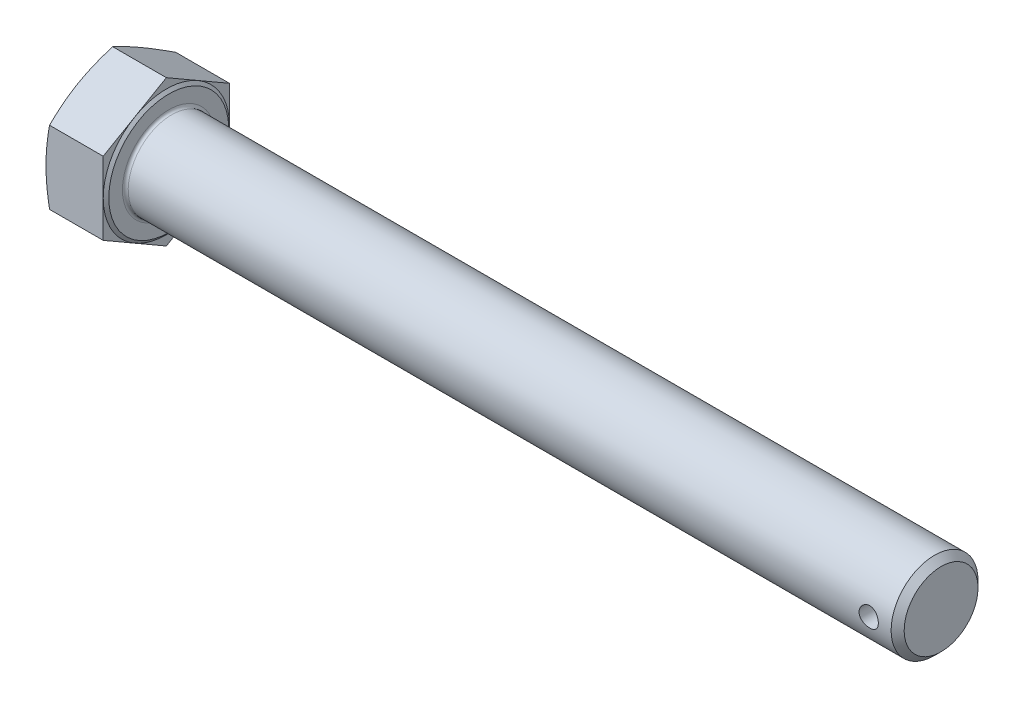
ISO-10303-21;
HEADER;
FILE_DESCRIPTION(('STEP AP214'),'2;1');
FILE_NAME('part.step','',(''),(''),'','','');
FILE_SCHEMA(('AUTOMOTIVE_DESIGN { 1 0 10303 214 1 1 1 1 }'));
ENDSEC;
DATA;
#1=APPLICATION_CONTEXT('core data for automotive mechanical design processes');
#2=APPLICATION_PROTOCOL_DEFINITION('international standard','automotive_design',2000,#1);
#3=PRODUCT_CONTEXT('',#1,'mechanical');
#4=PRODUCT('Part','Part','',(#3));
#5=PRODUCT_RELATED_PRODUCT_CATEGORY('part','',(#4));
#6=PRODUCT_DEFINITION_FORMATION('','',#4);
#7=PRODUCT_DEFINITION_CONTEXT('part definition',#1,'design');
#8=PRODUCT_DEFINITION('design','',#6,#7);
#9=PRODUCT_DEFINITION_SHAPE('','',#8);
#10=(LENGTH_UNIT() NAMED_UNIT(*) SI_UNIT(.MILLI.,.METRE.));
#11=(NAMED_UNIT(*) PLANE_ANGLE_UNIT() SI_UNIT($,.RADIAN.));
#12=(NAMED_UNIT(*) SI_UNIT($,.STERADIAN.) SOLID_ANGLE_UNIT());
#13=UNCERTAINTY_MEASURE_WITH_UNIT(LENGTH_MEASURE(1.E-05),#10,'distance_accuracy_value','');
#14=(GEOMETRIC_REPRESENTATION_CONTEXT(3) GLOBAL_UNCERTAINTY_ASSIGNED_CONTEXT((#13)) GLOBAL_UNIT_ASSIGNED_CONTEXT((#10,
#11,#12)) REPRESENTATION_CONTEXT('',''));
#15=CARTESIAN_POINT('',(0.,0.,0.));
#16=DIRECTION('',(0.,0.,1.));
#17=DIRECTION('',(1.,0.,0.));
#18=AXIS2_PLACEMENT_3D('',#15,#16,#17);
#19=CARTESIAN_POINT('',(12.35,0.,0.));
#20=DIRECTION('',(-1.,0.,0.));
#21=DIRECTION('',(0.,-1.,0.));
#22=AXIS2_PLACEMENT_3D('',#19,#20,#21);
#23=PLANE('',#22);
#24=CARTESIAN_POINT('',(12.35,0.,0.));
#25=DIRECTION('',(-1.,0.,0.));
#26=DIRECTION('',(0.,-1.,0.));
#27=AXIS2_PLACEMENT_3D('',#24,#25,#26);
#28=CIRCLE('',#27,9.6);
#29=CARTESIAN_POINT('',(12.35,-9.6,0.));
#30=VERTEX_POINT('',#29);
#31=EDGE_CURVE('E11',#30,#30,#28,.T.);
#32=ORIENTED_EDGE('',*,*,#31,.T.);
#33=EDGE_LOOP('',(#32));
#34=FACE_BOUND('',#33,.T.);
#35=CARTESIAN_POINT('',(12.35,0.,0.));
#36=DIRECTION('',(-1.,0.,0.));
#37=DIRECTION('',(0.,-1.,0.));
#38=AXIS2_PLACEMENT_3D('',#35,#36,#37);
#39=CIRCLE('',#38,12.425);
#40=CARTESIAN_POINT('',(12.35,-12.425,0.));
#41=VERTEX_POINT('',#40);
#42=EDGE_CURVE('E146',#41,#41,#39,.T.);
#43=ORIENTED_EDGE('',*,*,#42,.F.);
#44=EDGE_LOOP('',(#43));
#45=FACE_BOUND('',#44,.T.);
#46=ADVANCED_FACE('F32',(#34,#45),#23,.F.);
#47=CARTESIAN_POINT('',(11.85,0.,26.16));
#48=DIRECTION('',(-1.,0.,0.));
#49=DIRECTION('',(0.,0.,1.));
#50=AXIS2_PLACEMENT_3D('',#47,#48,#49);
#51=PLANE('',#50);
#52=DIRECTION('',(0.,-0.5,-0.866025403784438));
#53=VECTOR('',#52,1.);
#54=CARTESIAN_POINT('',(11.85,-7.5517415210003,13.08));
#55=LINE('',#54,#53);
#56=CARTESIAN_POINT('',(11.85,-7.5517415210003,13.08));
#57=VERTEX_POINT('',#56);
#58=CARTESIAN_POINT('',(11.85,-11.3276122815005,6.54));
#59=VERTEX_POINT('',#58);
#60=EDGE_CURVE('E145',#57,#59,#55,.T.);
#61=ORIENTED_EDGE('',*,*,#60,.T.);
#62=CARTESIAN_POINT('',(11.85,0.,0.));
#63=DIRECTION('',(-1.,0.,0.));
#64=DIRECTION('',(0.,-1.,0.));
#65=AXIS2_PLACEMENT_3D('',#62,#63,#64);
#66=CIRCLE('',#65,13.08);
#67=CARTESIAN_POINT('',(11.85,0.,13.08));
#68=VERTEX_POINT('',#67);
#69=EDGE_CURVE('E54',#59,#68,#66,.T.);
#70=ORIENTED_EDGE('',*,*,#69,.T.);
#71=DIRECTION('',(0.,-1.,0.));
#72=VECTOR('',#71,1.);
#73=CARTESIAN_POINT('',(11.85,7.55174152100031,13.08));
#74=LINE('',#73,#72);
#75=EDGE_CURVE('E142',#68,#57,#74,.T.);
#76=ORIENTED_EDGE('',*,*,#75,.T.);
#77=EDGE_LOOP('',(#61,#70,#76));
#78=FACE_BOUND('',#77,.T.);
#79=ADVANCED_FACE('F141',(#78),#51,.F.);
#80=CARTESIAN_POINT('',(11.85,7.55174152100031,13.08));
#81=VERTEX_POINT('',#80);
#82=EDGE_CURVE('E153',#81,#68,#74,.T.);
#83=ORIENTED_EDGE('',*,*,#82,.T.);
#84=CARTESIAN_POINT('',(11.85,11.3276122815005,6.54));
#85=VERTEX_POINT('',#84);
#86=EDGE_CURVE('E128',#68,#85,#66,.T.);
#87=ORIENTED_EDGE('',*,*,#86,.T.);
#88=DIRECTION('',(0.,-0.5,0.866025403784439));
#89=VECTOR('',#88,1.);
#90=CARTESIAN_POINT('',(11.85,15.1034830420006,0.));
#91=LINE('',#90,#89);
#92=EDGE_CURVE('E159',#85,#81,#91,.T.);
#93=ORIENTED_EDGE('',*,*,#92,.T.);
#94=EDGE_LOOP('',(#83,#87,#93));
#95=FACE_BOUND('',#94,.T.);
#96=ADVANCED_FACE('F158',(#95),#51,.F.);
#97=CARTESIAN_POINT('',(11.85,15.1034830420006,0.));
#98=VERTEX_POINT('',#97);
#99=EDGE_CURVE('E156',#98,#85,#91,.T.);
#100=ORIENTED_EDGE('',*,*,#99,.T.);
#101=CARTESIAN_POINT('',(11.85,11.3276122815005,-6.54));
#102=VERTEX_POINT('',#101);
#103=EDGE_CURVE('E132',#85,#102,#66,.T.);
#104=ORIENTED_EDGE('',*,*,#103,.T.);
#105=DIRECTION('',(0.,0.5,0.866025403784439));
#106=VECTOR('',#105,1.);
#107=CARTESIAN_POINT('',(11.85,7.55174152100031,-13.08));
#108=LINE('',#107,#106);
#109=EDGE_CURVE('E325',#102,#98,#108,.T.);
#110=ORIENTED_EDGE('',*,*,#109,.T.);
#111=EDGE_LOOP('',(#100,#104,#110));
#112=FACE_BOUND('',#111,.T.);
#113=ADVANCED_FACE('F314',(#112),#51,.F.);
#114=CARTESIAN_POINT('',(11.85,7.55174152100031,-13.08));
#115=VERTEX_POINT('',#114);
#116=EDGE_CURVE('E328',#115,#102,#108,.T.);
#117=ORIENTED_EDGE('',*,*,#116,.T.);
#118=CARTESIAN_POINT('',(11.85,0.,-13.08));
#119=VERTEX_POINT('',#118);
#120=EDGE_CURVE('E386',#102,#119,#66,.T.);
#121=ORIENTED_EDGE('',*,*,#120,.T.);
#122=DIRECTION('',(0.,1.,0.));
#123=VECTOR('',#122,1.);
#124=CARTESIAN_POINT('',(11.85,-7.55174152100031,-13.08));
#125=LINE('',#124,#123);
#126=EDGE_CURVE('E326',#119,#115,#125,.T.);
#127=ORIENTED_EDGE('',*,*,#126,.T.);
#128=EDGE_LOOP('',(#117,#121,#127));
#129=FACE_BOUND('',#128,.T.);
#130=ADVANCED_FACE('F307',(#129),#51,.F.);
#131=CARTESIAN_POINT('',(11.85,-7.55174152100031,-13.08));
#132=VERTEX_POINT('',#131);
#133=EDGE_CURVE('E319',#132,#119,#125,.T.);
#134=ORIENTED_EDGE('',*,*,#133,.T.);
#135=CARTESIAN_POINT('',(11.85,-11.3276122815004,-6.53999999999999));
#136=VERTEX_POINT('',#135);
#137=EDGE_CURVE('E320',#119,#136,#66,.T.);
#138=ORIENTED_EDGE('',*,*,#137,.T.);
#139=DIRECTION('',(0.,0.5,-0.866025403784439));
#140=VECTOR('',#139,1.);
#141=CARTESIAN_POINT('',(11.85,-15.1034830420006,0.));
#142=LINE('',#141,#140);
#143=EDGE_CURVE('E322',#136,#132,#142,.T.);
#144=ORIENTED_EDGE('',*,*,#143,.T.);
#145=EDGE_LOOP('',(#134,#138,#144));
#146=FACE_BOUND('',#145,.T.);
#147=ADVANCED_FACE('F299',(#146),#51,.F.);
#148=CARTESIAN_POINT('',(11.85,-7.5517415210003,13.08));
#149=DIRECTION('',(0.,0.866025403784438,-0.5));
#150=DIRECTION('',(0.,0.5,0.866025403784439));
#151=AXIS2_PLACEMENT_3D('',#148,#149,#150);
#152=PLANE('',#151);
#153=CARTESIAN_POINT('',(0.736529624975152,-15.1035985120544,-0.000199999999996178));
#154=CARTESIAN_POINT('',(0.62266016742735,-14.7908547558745,0.541488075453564));
#155=CARTESIAN_POINT('',(0.519076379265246,-14.4770797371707,1.08496234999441));
#156=CARTESIAN_POINT('',(0.336836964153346,-13.8474895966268,2.17544446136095));
#157=CARTESIAN_POINT('',(0.258200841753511,-13.5316730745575,2.72245472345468));
#158=CARTESIAN_POINT('',(0.131009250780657,-12.9015045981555,3.81393854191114));
#159=CARTESIAN_POINT('',(0.082176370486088,-12.5871670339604,4.35838717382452));
#160=CARTESIAN_POINT('',(0.0166777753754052,-11.9577568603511,5.4485575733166));
#161=CARTESIAN_POINT('',(0.,-11.6426845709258,5.9942787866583));
#162=CARTESIAN_POINT('',(0.,-11.0125399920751,7.08572121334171));
#163=CARTESIAN_POINT('',(0.0166777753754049,-10.6974677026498,7.63144242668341));
#164=CARTESIAN_POINT('',(0.0821763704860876,-10.0680575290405,8.72161282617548));
#165=CARTESIAN_POINT('',(0.131009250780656,-9.75371996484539,9.26606145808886));
#166=CARTESIAN_POINT('',(0.258200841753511,-9.12355148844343,10.3575452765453));
#167=CARTESIAN_POINT('',(0.336836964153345,-8.80773496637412,10.9045555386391));
#168=CARTESIAN_POINT('',(0.519076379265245,-8.17814482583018,11.9950376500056));
#169=CARTESIAN_POINT('',(0.622660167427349,-7.86436980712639,12.5385119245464));
#170=CARTESIAN_POINT('',(0.736529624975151,-7.55162605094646,13.0802));
#171=B_SPLINE_CURVE_WITH_KNOTS('',3,(#153,#154,#155,#156,#157,#158,#159,#160,#161,#162,#163,
#164,#165,#166,#167,#168,#169,#170),.UNSPECIFIED.,.F.,.F.,(4,2,2,2,2,2,2,2,4),(0.,
1.90750055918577,3.81648878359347,5.70742558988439,7.59765301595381,9.48788044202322,
11.3788172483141,13.2878054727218,15.1953060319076),.UNSPECIFIED.);
#172=CARTESIAN_POINT('',(0.73648759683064,-15.1034830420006,0.));
#173=VERTEX_POINT('',#172);
#174=CARTESIAN_POINT('',(0.,-11.3276122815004,6.54));
#175=VERTEX_POINT('',#174);
#176=EDGE_CURVE('E367',#173,#175,#171,.T.);
#177=ORIENTED_EDGE('',*,*,#176,.F.);
#178=DIRECTION('',(-1.,0.,0.));
#179=VECTOR('',#178,1.);
#180=CARTESIAN_POINT('',(11.85,-15.1034830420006,0.));
#181=LINE('',#180,#179);
#182=CARTESIAN_POINT('',(11.85,-15.1034830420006,0.));
#183=VERTEX_POINT('',#182);
#184=EDGE_CURVE('E176',#183,#173,#181,.T.);
#185=ORIENTED_EDGE('',*,*,#184,.F.);
#186=EDGE_CURVE('E375',#59,#183,#55,.T.);
#187=ORIENTED_EDGE('',*,*,#186,.F.);
#188=ORIENTED_EDGE('',*,*,#60,.F.);
#189=DIRECTION('',(-1.,0.,0.));
#190=VECTOR('',#189,1.);
#191=CARTESIAN_POINT('',(11.85,-7.5517415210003,13.08));
#192=LINE('',#191,#190);
#193=CARTESIAN_POINT('',(0.736487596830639,-7.5517415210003,13.08));
#194=VERTEX_POINT('',#193);
#195=EDGE_CURVE('E155',#57,#194,#192,.T.);
#196=ORIENTED_EDGE('',*,*,#195,.T.);
#197=EDGE_CURVE('E256',#175,#194,#171,.T.);
#198=ORIENTED_EDGE('',*,*,#197,.F.);
#199=EDGE_LOOP('',(#177,#185,#187,#188,#196,#198));
#200=FACE_BOUND('',#199,.T.);
#201=ADVANCED_FACE('F34',(#200),#152,.F.);
#202=CARTESIAN_POINT('',(11.85,-15.1034830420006,0.));
#203=DIRECTION('',(0.,0.866025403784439,0.5));
#204=DIRECTION('',(0.,-0.5,0.866025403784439));
#205=AXIS2_PLACEMENT_3D('',#202,#203,#204);
#206=PLANE('',#205);
#207=CARTESIAN_POINT('',(0.736529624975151,-7.55162605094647,-13.0802));
#208=CARTESIAN_POINT('',(0.62266016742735,-7.86436980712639,-12.5385119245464));
#209=CARTESIAN_POINT('',(0.519076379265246,-8.17814482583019,-11.9950376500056));
#210=CARTESIAN_POINT('',(0.336836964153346,-8.80773496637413,-10.9045555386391));
#211=CARTESIAN_POINT('',(0.258200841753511,-9.12355148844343,-10.3575452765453));
#212=CARTESIAN_POINT('',(0.131009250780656,-9.75371996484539,-9.26606145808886));
#213=CARTESIAN_POINT('',(0.0821763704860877,-10.0680575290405,-8.72161282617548));
#214=CARTESIAN_POINT('',(0.0166777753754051,-10.6974677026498,-7.6314424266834));
#215=CARTESIAN_POINT('',(0.,-11.0125399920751,-7.0857212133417));
#216=CARTESIAN_POINT('',(0.,-11.6426845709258,-5.99427878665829));
#217=CARTESIAN_POINT('',(0.0166777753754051,-11.9577568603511,-5.44855757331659));
#218=CARTESIAN_POINT('',(0.0821763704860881,-12.5871670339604,-4.35838717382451));
#219=CARTESIAN_POINT('',(0.131009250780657,-12.9015045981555,-3.81393854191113));
#220=CARTESIAN_POINT('',(0.258200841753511,-13.5316730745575,-2.72245472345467));
#221=CARTESIAN_POINT('',(0.336836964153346,-13.8474895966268,-2.17544446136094));
#222=CARTESIAN_POINT('',(0.519076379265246,-14.4770797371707,-1.08496234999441));
#223=CARTESIAN_POINT('',(0.62266016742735,-14.7908547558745,-0.541488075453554));
#224=CARTESIAN_POINT('',(0.736529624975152,-15.1035985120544,0.000200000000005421));
#225=B_SPLINE_CURVE_WITH_KNOTS('',3,(#207,#208,#209,#210,#211,#212,#213,#214,#215,#216,#217,
#218,#219,#220,#221,#222,#223,#224),.UNSPECIFIED.,.F.,.F.,(4,2,2,2,2,2,2,2,4),(0.,
1.90750055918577,3.81648878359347,5.70742558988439,7.59765301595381,9.48788044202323,
11.3788172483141,13.2878054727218,15.1953060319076),.UNSPECIFIED.);
#226=CARTESIAN_POINT('',(0.736487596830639,-7.5517415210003,-13.08));
#227=VERTEX_POINT('',#226);
#228=CARTESIAN_POINT('',(0.,-11.3276122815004,-6.53999999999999));
#229=VERTEX_POINT('',#228);
#230=EDGE_CURVE('E271',#227,#229,#225,.T.);
#231=ORIENTED_EDGE('',*,*,#230,.F.);
#232=DIRECTION('',(-1.,0.,0.));
#233=VECTOR('',#232,1.);
#234=CARTESIAN_POINT('',(11.85,-7.55174152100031,-13.08));
#235=LINE('',#234,#233);
#236=EDGE_CURVE('E173',#132,#227,#235,.T.);
#237=ORIENTED_EDGE('',*,*,#236,.F.);
#238=ORIENTED_EDGE('',*,*,#143,.F.);
#239=EDGE_CURVE('E329',#183,#136,#142,.T.);
#240=ORIENTED_EDGE('',*,*,#239,.F.);
#241=ORIENTED_EDGE('',*,*,#184,.T.);
#242=EDGE_CURVE('E267',#229,#173,#225,.T.);
#243=ORIENTED_EDGE('',*,*,#242,.F.);
#244=EDGE_LOOP('',(#231,#237,#238,#240,#241,#243));
#245=FACE_BOUND('',#244,.T.);
#246=ADVANCED_FACE('F278',(#245),#206,.F.);
#247=CARTESIAN_POINT('',(11.85,-7.55174152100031,-13.08));
#248=DIRECTION('',(0.,0.,1.));
#249=DIRECTION('',(0.,-1.,0.));
#250=AXIS2_PLACEMENT_3D('',#247,#248,#249);
#251=PLANE('',#250);
#252=CARTESIAN_POINT('',(3.93549834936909,-19.9943584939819,-13.08));
#253=CARTESIAN_POINT('',(3.84537692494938,-19.6984695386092,-13.08));
#254=CARTESIAN_POINT('',(3.75580051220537,-19.402414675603,-13.08));
#255=CARTESIAN_POINT('',(3.57785972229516,-18.8099391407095,-13.08));
#256=CARTESIAN_POINT('',(3.48949535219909,-18.5135184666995,-13.08));
#257=CARTESIAN_POINT('',(3.22639193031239,-17.623618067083,-13.08));
#258=CARTESIAN_POINT('',(3.05365592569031,-17.0295436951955,-13.08));
#259=CARTESIAN_POINT('',(2.71443961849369,-15.8384086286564,-13.08));
#260=CARTESIAN_POINT('',(2.54797158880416,-15.2413444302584,-13.08));
#261=CARTESIAN_POINT('',(2.22322585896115,-14.0449953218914,-13.08));
#262=CARTESIAN_POINT('',(2.06494801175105,-13.4457104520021,-13.08));
#263=CARTESIAN_POINT('',(1.76050409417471,-12.2519256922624,-13.08));
#264=CARTESIAN_POINT('',(1.61421275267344,-11.6574579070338,-13.08));
#265=CARTESIAN_POINT('',(1.33408482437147,-10.4655642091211,-13.08));
#266=CARTESIAN_POINT('',(1.20024844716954,-9.8681382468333,-13.08));
#267=CARTESIAN_POINT('',(0.948150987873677,-8.67019448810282,-13.08));
#268=CARTESIAN_POINT('',(0.829884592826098,-8.06967781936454,-13.08));
#269=CARTESIAN_POINT('',(0.61252820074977,-6.86515806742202,-13.08));
#270=CARTESIAN_POINT('',(0.513437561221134,-6.26115510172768,-13.08));
#271=CARTESIAN_POINT('',(0.348269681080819,-5.1176759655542,-13.08));
#272=CARTESIAN_POINT('',(0.279736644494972,-4.57855785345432,-13.08));
#273=CARTESIAN_POINT('',(0.163726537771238,-3.49804197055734,-13.08));
#274=CARTESIAN_POINT('',(0.11624885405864,-2.95664426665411,-13.08));
#275=CARTESIAN_POINT('',(0.0446358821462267,-1.87266735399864,-13.08));
#276=CARTESIAN_POINT('',(0.0204840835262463,-1.33008925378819,-13.08));
#277=CARTESIAN_POINT('',(-0.00325431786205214,-0.244390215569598,-13.08));
#278=CARTESIAN_POINT('',(-0.00284109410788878,0.298730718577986,-13.08));
#279=CARTESIAN_POINT('',(0.0225924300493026,1.38714249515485,-13.08));
#280=CARTESIAN_POINT('',(0.0477375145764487,1.93243037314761,-13.08));
#281=CARTESIAN_POINT('',(0.121477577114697,3.02140448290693,-13.08));
#282=CARTESIAN_POINT('',(0.170073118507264,3.56509067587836,-13.08));
#283=CARTESIAN_POINT('',(0.288440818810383,4.65059295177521,-13.08));
#284=CARTESIAN_POINT('',(0.358231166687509,5.19240702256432,-13.08));
#285=CARTESIAN_POINT('',(0.516157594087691,6.27332459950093,-13.08));
#286=CARTESIAN_POINT('',(0.604293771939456,6.8124280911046,-13.08));
#287=CARTESIAN_POINT('',(0.801115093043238,7.91629318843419,-13.08));
#288=CARTESIAN_POINT('',(0.910640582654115,8.48090362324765,-13.08));
#289=CARTESIAN_POINT('',(1.1437881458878,9.60722508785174,-13.08));
#290=CARTESIAN_POINT('',(1.26741128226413,10.1689358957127,-13.08));
#291=CARTESIAN_POINT('',(1.52615829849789,11.2898583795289,-13.08));
#292=CARTESIAN_POINT('',(1.66128551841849,11.8490692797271,-13.08));
#293=CARTESIAN_POINT('',(1.940842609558,12.9651353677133,-13.08));
#294=CARTESIAN_POINT('',(2.08527225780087,13.5219906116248,-13.08));
#295=CARTESIAN_POINT('',(2.3818855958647,14.634390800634,-13.08));
#296=CARTESIAN_POINT('',(2.53407900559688,15.1899331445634,-13.08));
#297=CARTESIAN_POINT('',(2.84465724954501,16.2992820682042,-13.08));
#298=CARTESIAN_POINT('',(3.0030421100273,16.8530886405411,-13.08));
#299=CARTESIAN_POINT('',(3.32486841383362,17.9591267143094,-13.08));
#300=CARTESIAN_POINT('',(3.48830900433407,18.5113584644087,-13.08));
#301=CARTESIAN_POINT('',(3.81939964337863,19.6145548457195,-13.08));
#302=CARTESIAN_POINT('',(3.98704968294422,20.1655194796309,-13.08));
#303=CARTESIAN_POINT('',(4.4914870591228,21.8046460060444,-13.08));
#304=CARTESIAN_POINT('',(4.83335007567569,22.8912455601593,-13.08));
#305=CARTESIAN_POINT('',(5.52676383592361,25.0613908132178,-13.08));
#306=CARTESIAN_POINT('',(5.87831504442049,26.1449363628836,-13.08));
#307=CARTESIAN_POINT('',(6.58717433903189,28.3055867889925,-13.08));
#308=CARTESIAN_POINT('',(6.94445552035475,29.382700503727,-13.08));
#309=CARTESIAN_POINT('',(7.48434059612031,30.9969938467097,-13.08));
#310=CARTESIAN_POINT('',(7.6649554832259,31.5348404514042,-13.08));
#311=CARTESIAN_POINT('',(8.02735396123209,32.6101383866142,-13.08));
#312=CARTESIAN_POINT('',(8.20913754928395,33.1475897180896,-13.08));
#313=CARTESIAN_POINT('',(8.39142742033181,33.6848693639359,-13.08));
#314=B_SPLINE_CURVE_WITH_KNOTS('',3,(#252,#253,#254,#255,#256,#257,#258,#259,#260,#261,#262,
#263,#264,#265,#266,#267,#268,#269,#270,#271,#272,#273,#274,#275,#276,#277,#278,#279,#280,#281,
#282,#283,#284,#285,#286,#287,#288,#289,#290,#291,#292,#293,#294,#295,#296,#297,#298,#299,#300,
#301,#302,#303,#304,#305,#306,#307,#308,#309,#310,#311,#312,#313),.UNSPECIFIED.,.F.,.F.,(4,2,2,
2,2,2,2,2,2,2,2,2,2,2,2,2,2,2,2,2,2,2,2,2,2,2,2,2,2,2,4),(0.,0.927926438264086,1.85585828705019,
3.71185915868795,5.57132286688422,7.43075317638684,9.26725767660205,11.1037930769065,
12.9397001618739,14.775545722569,16.4055576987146,18.0355221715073,19.6643320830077,
21.2931304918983,22.9301893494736,24.5672875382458,26.2057946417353,27.8443105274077,
29.5694962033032,31.2948120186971,33.0206304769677,34.7464075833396,36.4744010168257,
38.2024017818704,39.9301126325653,41.6578197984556,45.0750724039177,48.4924892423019,
51.8969392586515,53.5990271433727,55.3011108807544),.UNSPECIFIED.);
#315=CARTESIAN_POINT('',(0.736487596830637,7.55174152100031,-13.08));
#316=VERTEX_POINT('',#315);
#317=CARTESIAN_POINT('',(0.,0.,-13.08));
#318=VERTEX_POINT('',#317);
#319=EDGE_CURVE('E376',#316,#318,#314,.F.);
#320=ORIENTED_EDGE('',*,*,#319,.F.);
#321=DIRECTION('',(-1.,0.,0.));
#322=VECTOR('',#321,1.);
#323=CARTESIAN_POINT('',(11.85,7.55174152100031,-13.08));
#324=LINE('',#323,#322);
#325=EDGE_CURVE('E170',#115,#316,#324,.T.);
#326=ORIENTED_EDGE('',*,*,#325,.F.);
#327=ORIENTED_EDGE('',*,*,#126,.F.);
#328=ORIENTED_EDGE('',*,*,#133,.F.);
#329=ORIENTED_EDGE('',*,*,#236,.T.);
#330=EDGE_CURVE('E272',#318,#227,#314,.F.);
#331=ORIENTED_EDGE('',*,*,#330,.F.);
#332=EDGE_LOOP('',(#320,#326,#327,#328,#329,#331));
#333=FACE_BOUND('',#332,.T.);
#334=ADVANCED_FACE('F281',(#333),#251,.F.);
#335=CARTESIAN_POINT('',(11.85,7.55174152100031,-13.08));
#336=DIRECTION('',(0.,-0.866025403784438,0.5));
#337=DIRECTION('',(0.,-0.5,-0.866025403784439));
#338=AXIS2_PLACEMENT_3D('',#335,#336,#337);
#339=PLANE('',#338);
#340=CARTESIAN_POINT('',(0.736529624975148,15.1035985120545,0.000199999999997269));
#341=CARTESIAN_POINT('',(0.622660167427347,14.7908547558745,-0.541488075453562));
#342=CARTESIAN_POINT('',(0.519076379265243,14.4770797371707,-1.08496234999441));
#343=CARTESIAN_POINT('',(0.336836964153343,13.8474895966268,-2.17544446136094));
#344=CARTESIAN_POINT('',(0.258200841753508,13.5316730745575,-2.72245472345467));
#345=CARTESIAN_POINT('',(0.131009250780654,12.9015045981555,-3.81393854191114));
#346=CARTESIAN_POINT('',(0.0821763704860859,12.5871670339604,-4.35838717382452));
#347=CARTESIAN_POINT('',(0.0166777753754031,11.9577568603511,-5.44855757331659));
#348=CARTESIAN_POINT('',(0.,11.6426845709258,-5.9942787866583));
#349=CARTESIAN_POINT('',(0.,11.0125399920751,-7.0857212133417));
#350=CARTESIAN_POINT('',(0.0166777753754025,10.6974677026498,-7.63144242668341));
#351=CARTESIAN_POINT('',(0.0821763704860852,10.0680575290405,-8.72161282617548));
#352=CARTESIAN_POINT('',(0.131009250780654,9.7537199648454,-9.26606145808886));
#353=CARTESIAN_POINT('',(0.258200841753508,9.12355148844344,-10.3575452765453));
#354=CARTESIAN_POINT('',(0.336836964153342,8.80773496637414,-10.9045555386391));
#355=CARTESIAN_POINT('',(0.519076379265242,8.1781448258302,-11.9950376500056));
#356=CARTESIAN_POINT('',(0.622660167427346,7.8643698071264,-12.5385119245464));
#357=CARTESIAN_POINT('',(0.736529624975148,7.55162605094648,-13.0802));
#358=B_SPLINE_CURVE_WITH_KNOTS('',3,(#340,#341,#342,#343,#344,#345,#346,#347,#348,#349,#350,
#351,#352,#353,#354,#355,#356,#357),.UNSPECIFIED.,.F.,.F.,(4,2,2,2,2,2,2,2,4),(0.,
1.90750055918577,3.81648878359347,5.70742558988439,7.59765301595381,9.48788044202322,
11.3788172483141,13.2878054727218,15.1953060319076),.UNSPECIFIED.);
#359=CARTESIAN_POINT('',(0.736487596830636,15.1034830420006,0.));
#360=VERTEX_POINT('',#359);
#361=CARTESIAN_POINT('',(0.,11.3276122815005,-6.53999999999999));
#362=VERTEX_POINT('',#361);
#363=EDGE_CURVE('E261',#360,#362,#358,.T.);
#364=ORIENTED_EDGE('',*,*,#363,.F.);
#365=DIRECTION('',(-1.,0.,0.));
#366=VECTOR('',#365,1.);
#367=CARTESIAN_POINT('',(11.85,15.1034830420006,0.));
#368=LINE('',#367,#366);
#369=EDGE_CURVE('E167',#98,#360,#368,.T.);
#370=ORIENTED_EDGE('',*,*,#369,.F.);
#371=ORIENTED_EDGE('',*,*,#109,.F.);
#372=ORIENTED_EDGE('',*,*,#116,.F.);
#373=ORIENTED_EDGE('',*,*,#325,.T.);
#374=EDGE_CURVE('E368',#362,#316,#358,.T.);
#375=ORIENTED_EDGE('',*,*,#374,.F.);
#376=EDGE_LOOP('',(#364,#370,#371,#372,#373,#375));
#377=FACE_BOUND('',#376,.T.);
#378=ADVANCED_FACE('F285',(#377),#339,.F.);
#379=CARTESIAN_POINT('',(11.85,15.1034830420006,0.));
#380=DIRECTION('',(0.,-0.866025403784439,-0.5));
#381=DIRECTION('',(0.,0.5,-0.866025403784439));
#382=AXIS2_PLACEMENT_3D('',#379,#380,#381);
#383=PLANE('',#382);
#384=CARTESIAN_POINT('',(0.736529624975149,7.55162605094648,13.0802));
#385=CARTESIAN_POINT('',(0.622660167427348,7.8643698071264,12.5385119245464));
#386=CARTESIAN_POINT('',(0.519076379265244,8.17814482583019,11.9950376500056));
#387=CARTESIAN_POINT('',(0.336836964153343,8.80773496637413,10.9045555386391));
#388=CARTESIAN_POINT('',(0.258200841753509,9.12355148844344,10.3575452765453));
#389=CARTESIAN_POINT('',(0.131009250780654,9.7537199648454,9.26606145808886));
#390=CARTESIAN_POINT('',(0.0821763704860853,10.0680575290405,8.72161282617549));
#391=CARTESIAN_POINT('',(0.0166777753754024,10.6974677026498,7.63144242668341));
#392=CARTESIAN_POINT('',(0.,11.0125399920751,7.0857212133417));
#393=CARTESIAN_POINT('',(0.,11.6426845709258,5.9942787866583));
#394=CARTESIAN_POINT('',(0.016677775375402,11.9577568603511,5.44855757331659));
#395=CARTESIAN_POINT('',(0.0821763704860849,12.5871670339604,4.35838717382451));
#396=CARTESIAN_POINT('',(0.131009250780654,12.9015045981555,3.81393854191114));
#397=CARTESIAN_POINT('',(0.258200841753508,13.5316730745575,2.72245472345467));
#398=CARTESIAN_POINT('',(0.336836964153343,13.8474895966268,2.17544446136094));
#399=CARTESIAN_POINT('',(0.519076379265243,14.4770797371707,1.08496234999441));
#400=CARTESIAN_POINT('',(0.622660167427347,14.7908547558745,0.541488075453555));
#401=CARTESIAN_POINT('',(0.736529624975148,15.1035985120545,-0.00020000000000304));
#402=B_SPLINE_CURVE_WITH_KNOTS('',3,(#384,#385,#386,#387,#388,#389,#390,#391,#392,#393,#394,
#395,#396,#397,#398,#399,#400,#401),.UNSPECIFIED.,.F.,.F.,(4,2,2,2,2,2,2,2,4),(0.,
1.90750055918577,3.81648878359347,5.70742558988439,7.59765301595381,9.48788044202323,
11.3788172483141,13.2878054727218,15.1953060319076),.UNSPECIFIED.);
#403=CARTESIAN_POINT('',(0.736487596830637,7.55174152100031,13.08));
#404=VERTEX_POINT('',#403);
#405=CARTESIAN_POINT('',(0.,11.3276122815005,6.54));
#406=VERTEX_POINT('',#405);
#407=EDGE_CURVE('E249',#404,#406,#402,.T.);
#408=ORIENTED_EDGE('',*,*,#407,.F.);
#409=DIRECTION('',(-1.,0.,0.));
#410=VECTOR('',#409,1.);
#411=CARTESIAN_POINT('',(11.85,7.55174152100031,13.08));
#412=LINE('',#411,#410);
#413=EDGE_CURVE('E161',#81,#404,#412,.T.);
#414=ORIENTED_EDGE('',*,*,#413,.F.);
#415=ORIENTED_EDGE('',*,*,#92,.F.);
#416=ORIENTED_EDGE('',*,*,#99,.F.);
#417=ORIENTED_EDGE('',*,*,#369,.T.);
#418=EDGE_CURVE('E360',#406,#360,#402,.T.);
#419=ORIENTED_EDGE('',*,*,#418,.F.);
#420=EDGE_LOOP('',(#408,#414,#415,#416,#417,#419));
#421=FACE_BOUND('',#420,.T.);
#422=ADVANCED_FACE('F289',(#421),#383,.F.);
#423=CARTESIAN_POINT('',(11.85,7.55174152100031,13.08));
#424=DIRECTION('',(0.,0.,-1.));
#425=DIRECTION('',(-1.,0.,0.));
#426=AXIS2_PLACEMENT_3D('',#423,#424,#425);
#427=PLANE('',#426);
#428=CARTESIAN_POINT('',(3.93549764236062,-19.9943561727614,13.08));
#429=CARTESIAN_POINT('',(3.84537623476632,-19.6984672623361,13.08));
#430=CARTESIAN_POINT('',(3.75579983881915,-19.4024124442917,13.08));
#431=CARTESIAN_POINT('',(3.57785908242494,-18.8099369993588,13.08));
#432=CARTESIAN_POINT('',(3.48949472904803,-18.5135163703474,13.08));
#433=CARTESIAN_POINT('',(3.2263913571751,-17.6236161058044,13.08));
#434=CARTESIAN_POINT('',(3.05365538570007,-17.0295418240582,13.08));
#435=CARTESIAN_POINT('',(2.71443914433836,-15.8384069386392,13.08));
#436=CARTESIAN_POINT('',(2.54797114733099,-15.2413428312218,13.08));
#437=CARTESIAN_POINT('',(2.22322548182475,-14.044993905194,13.08));
#438=CARTESIAN_POINT('',(2.06494766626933,-13.4457091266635,13.08));
#439=CARTESIAN_POINT('',(1.76050381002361,-12.2519245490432,13.08));
#440=CARTESIAN_POINT('',(1.61421249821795,-11.6574568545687,13.08));
#441=CARTESIAN_POINT('',(1.33408462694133,-10.4655633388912,13.08));
#442=CARTESIAN_POINT('',(1.20024827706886,-9.86813746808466,13.08));
#443=CARTESIAN_POINT('',(0.948150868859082,-8.67019389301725,13.08));
#444=CARTESIAN_POINT('',(0.829884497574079,-8.06967731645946,13.08));
#445=CARTESIAN_POINT('',(0.612528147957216,-6.86515774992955,13.08));
#446=CARTESIAN_POINT('',(0.513437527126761,-6.26115487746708,13.08));
#447=CARTESIAN_POINT('',(0.348269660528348,-5.11767581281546,13.08));
#448=CARTESIAN_POINT('',(0.279736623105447,-4.57855767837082,13.08));
#449=CARTESIAN_POINT('',(0.163726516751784,-3.49804175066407,13.08));
#450=CARTESIAN_POINT('',(0.116248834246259,-2.95664402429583,13.08));
#451=CARTESIAN_POINT('',(0.044635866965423,-1.87266706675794,13.08));
#452=CARTESIAN_POINT('',(0.02048407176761,-1.33008894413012,13.08));
#453=CARTESIAN_POINT('',(-0.0032543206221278,-0.244389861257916,13.08));
#454=CARTESIAN_POINT('',(-0.00284109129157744,0.298731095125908,13.08));
#455=CARTESIAN_POINT('',(0.0225924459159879,1.38714291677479,13.08));
#456=CARTESIAN_POINT('',(0.0477375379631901,1.93243081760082,13.08));
#457=CARTESIAN_POINT('',(0.121477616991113,3.02140497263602,13.08));
#458=CARTESIAN_POINT('',(0.170073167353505,3.56509118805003,13.08));
#459=CARTESIAN_POINT('',(0.288440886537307,4.65059350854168,13.08));
#460=CARTESIAN_POINT('',(0.358231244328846,5.19240760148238,13.08));
#461=CARTESIAN_POINT('',(0.516157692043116,6.27332522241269,13.08));
#462=CARTESIAN_POINT('',(0.604293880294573,6.81242873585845,13.08));
#463=CARTESIAN_POINT('',(0.801115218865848,7.91629385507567,13.08));
#464=CARTESIAN_POINT('',(0.910640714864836,8.48090429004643,13.08));
#465=CARTESIAN_POINT('',(1.14378828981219,9.60722575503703,13.08));
#466=CARTESIAN_POINT('',(1.26741143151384,10.1689365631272,13.08));
#467=CARTESIAN_POINT('',(1.52615845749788,11.2898590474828,13.08));
#468=CARTESIAN_POINT('',(1.66128568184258,11.8490699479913,13.08));
#469=CARTESIAN_POINT('',(1.94084278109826,12.9651360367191,13.08));
#470=CARTESIAN_POINT('',(2.08527243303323,13.5219912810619,13.08));
#471=CARTESIAN_POINT('',(2.38188577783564,14.6343914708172,13.08));
#472=CARTESIAN_POINT('',(2.53407919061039,15.1899338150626,13.08));
#473=CARTESIAN_POINT('',(2.84465744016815,16.2992827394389,13.08));
#474=CARTESIAN_POINT('',(3.00304230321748,16.8530893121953,13.08));
#475=CARTESIAN_POINT('',(3.32486861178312,17.9591273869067,13.08));
#476=CARTESIAN_POINT('',(3.48830920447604,18.5113591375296,13.08));
#477=CARTESIAN_POINT('',(3.81939984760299,19.6145555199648,13.08));
#478=CARTESIAN_POINT('',(3.98704988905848,20.165520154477,13.08));
#479=CARTESIAN_POINT('',(4.49148726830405,21.8046466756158,13.08));
#480=CARTESIAN_POINT('',(4.83335028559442,22.8912462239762,13.08));
#481=CARTESIAN_POINT('',(5.52676404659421,25.061391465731,13.08));
#482=CARTESIAN_POINT('',(5.8783152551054,26.1449370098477,13.08));
#483=CARTESIAN_POINT('',(6.5871745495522,28.3055874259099,13.08));
#484=CARTESIAN_POINT('',(6.94445573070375,29.3827011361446,13.08));
#485=CARTESIAN_POINT('',(7.48434080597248,30.9969944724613,13.08));
#486=CARTESIAN_POINT('',(7.66495569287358,31.5348410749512,13.08));
#487=CARTESIAN_POINT('',(8.02735417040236,32.610139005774,13.08));
#488=CARTESIAN_POINT('',(8.20913775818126,33.1475903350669,13.08));
#489=CARTESIAN_POINT('',(8.39142762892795,33.6848699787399,13.08));
#490=B_SPLINE_CURVE_WITH_KNOTS('',3,(#428,#429,#430,#431,#432,#433,#434,#435,#436,#437,#438,
#439,#440,#441,#442,#443,#444,#445,#446,#447,#448,#449,#450,#451,#452,#453,#454,#455,#456,#457,
#458,#459,#460,#461,#462,#463,#464,#465,#466,#467,#468,#469,#470,#471,#472,#473,#474,#475,#476,
#477,#478,#479,#480,#481,#482,#483,#484,#485,#486,#487,#488,#489),.UNSPECIFIED.,.F.,.F.,(4,2,2,
2,2,2,2,2,2,2,2,2,2,2,2,2,2,2,2,2,2,2,2,2,2,2,2,2,2,2,4),(0.,0.927926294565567,1.85585799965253,
3.71185858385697,5.57132200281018,7.43075202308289,9.26725623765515,11.1037913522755,
12.9396981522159,14.7755434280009,16.4055554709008,18.0355200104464,19.6643299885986,
21.2931284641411,22.9301873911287,24.567285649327,26.2057928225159,27.8443087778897,
29.5694944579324,31.2948102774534,33.0206287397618,34.7464058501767,36.4743992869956,
38.2024000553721,39.930110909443,41.6578180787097,45.0750706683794,48.4924874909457,
51.8969374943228,53.5990253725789,55.301109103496),.UNSPECIFIED.);
#491=CARTESIAN_POINT('',(0.,0.,13.08));
#492=VERTEX_POINT('',#491);
#493=EDGE_CURVE('E342',#194,#492,#490,.T.);
#494=ORIENTED_EDGE('',*,*,#493,.F.);
#495=ORIENTED_EDGE('',*,*,#195,.F.);
#496=ORIENTED_EDGE('',*,*,#75,.F.);
#497=ORIENTED_EDGE('',*,*,#82,.F.);
#498=ORIENTED_EDGE('',*,*,#413,.T.);
#499=EDGE_CURVE('E239',#492,#404,#490,.T.);
#500=ORIENTED_EDGE('',*,*,#499,.F.);
#501=EDGE_LOOP('',(#494,#495,#496,#497,#498,#500));
#502=FACE_BOUND('',#501,.T.);
#503=ADVANCED_FACE('F151',(#502),#427,.F.);
#504=ORIENTED_EDGE('',*,*,#239,.T.);
#505=EDGE_CURVE('E147',#136,#59,#66,.T.);
#506=ORIENTED_EDGE('',*,*,#505,.T.);
#507=ORIENTED_EDGE('',*,*,#186,.T.);
#508=EDGE_LOOP('',(#504,#506,#507));
#509=FACE_BOUND('',#508,.T.);
#510=ADVANCED_FACE('F224',(#509),#51,.F.);
#511=CARTESIAN_POINT('',(0.,0.,0.));
#512=DIRECTION('',(1.,0.,0.));
#513=DIRECTION('',(0.,1.,0.));
#514=AXIS2_PLACEMENT_3D('',#511,#512,#513);
#515=CONICAL_SURFACE('',#514,13.08,1.22173047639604);
#516=ORIENTED_EDGE('',*,*,#197,.T.);
#517=ORIENTED_EDGE('',*,*,#493,.T.);
#518=CARTESIAN_POINT('',(0.,0.,0.));
#519=DIRECTION('',(-1.,0.,0.));
#520=DIRECTION('',(0.,-1.,0.));
#521=AXIS2_PLACEMENT_3D('',#518,#519,#520);
#522=CIRCLE('',#521,13.08);
#523=EDGE_CURVE('E62',#175,#492,#522,.T.);
#524=ORIENTED_EDGE('',*,*,#523,.F.);
#525=EDGE_LOOP('',(#516,#517,#524));
#526=FACE_BOUND('',#525,.T.);
#527=ADVANCED_FACE('F297',(#526),#515,.T.);
#528=ORIENTED_EDGE('',*,*,#242,.T.);
#529=ORIENTED_EDGE('',*,*,#176,.T.);
#530=CARTESIAN_POINT('',(0.,0.,0.));
#531=DIRECTION('',(-1.,0.,0.));
#532=DIRECTION('',(0.,0.,1.));
#533=AXIS2_PLACEMENT_3D('',#530,#531,#532);
#534=CIRCLE('',#533,13.08);
#535=EDGE_CURVE('E179',#229,#175,#534,.T.);
#536=ORIENTED_EDGE('',*,*,#535,.F.);
#537=EDGE_LOOP('',(#528,#529,#536));
#538=FACE_BOUND('',#537,.T.);
#539=ADVANCED_FACE('F303',(#538),#515,.T.);
#540=ORIENTED_EDGE('',*,*,#330,.T.);
#541=ORIENTED_EDGE('',*,*,#230,.T.);
#542=EDGE_CURVE('E384',#318,#229,#534,.T.);
#543=ORIENTED_EDGE('',*,*,#542,.F.);
#544=EDGE_LOOP('',(#540,#541,#543));
#545=FACE_BOUND('',#544,.T.);
#546=ADVANCED_FACE('F232',(#545),#515,.T.);
#547=ORIENTED_EDGE('',*,*,#319,.T.);
#548=EDGE_CURVE('E366',#362,#318,#534,.T.);
#549=ORIENTED_EDGE('',*,*,#548,.F.);
#550=ORIENTED_EDGE('',*,*,#374,.T.);
#551=EDGE_LOOP('',(#547,#549,#550));
#552=FACE_BOUND('',#551,.T.);
#553=ADVANCED_FACE('F227',(#552),#515,.T.);
#554=ORIENTED_EDGE('',*,*,#363,.T.);
#555=EDGE_CURVE('E182',#406,#362,#534,.T.);
#556=ORIENTED_EDGE('',*,*,#555,.F.);
#557=ORIENTED_EDGE('',*,*,#418,.T.);
#558=EDGE_LOOP('',(#554,#556,#557));
#559=FACE_BOUND('',#558,.T.);
#560=ADVANCED_FACE('F231',(#559),#515,.T.);
#561=ORIENTED_EDGE('',*,*,#407,.T.);
#562=EDGE_CURVE('E180',#492,#406,#534,.T.);
#563=ORIENTED_EDGE('',*,*,#562,.F.);
#564=ORIENTED_EDGE('',*,*,#499,.T.);
#565=EDGE_LOOP('',(#561,#563,#564));
#566=FACE_BOUND('',#565,.T.);
#567=ADVANCED_FACE('F234',(#566),#515,.T.);
#568=CARTESIAN_POINT('',(0.,0.,26.16));
#569=DIRECTION('',(-1.,0.,0.));
#570=DIRECTION('',(0.,0.,1.));
#571=AXIS2_PLACEMENT_3D('',#568,#569,#570);
#572=PLANE('',#571);
#573=ORIENTED_EDGE('',*,*,#523,.T.);
#574=ORIENTED_EDGE('',*,*,#562,.T.);
#575=ORIENTED_EDGE('',*,*,#555,.T.);
#576=ORIENTED_EDGE('',*,*,#548,.T.);
#577=ORIENTED_EDGE('',*,*,#542,.T.);
#578=ORIENTED_EDGE('',*,*,#535,.T.);
#579=EDGE_LOOP('',(#573,#574,#575,#576,#577,#578));
#580=FACE_BOUND('',#579,.T.);
#581=ADVANCED_FACE('F235',(#580),#572,.T.);
#582=CARTESIAN_POINT('',(12.35,0.,0.));
#583=DIRECTION('',(-1.,0.,0.));
#584=DIRECTION('',(0.,-1.,0.));
#585=AXIS2_PLACEMENT_3D('',#582,#583,#584);
#586=CONICAL_SURFACE('',#585,12.425,0.918800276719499);
#587=ORIENTED_EDGE('',*,*,#69,.F.);
#588=ORIENTED_EDGE('',*,*,#505,.F.);
#589=ORIENTED_EDGE('',*,*,#137,.F.);
#590=ORIENTED_EDGE('',*,*,#120,.F.);
#591=ORIENTED_EDGE('',*,*,#103,.F.);
#592=ORIENTED_EDGE('',*,*,#86,.F.);
#593=EDGE_LOOP('',(#587,#588,#589,#590,#591,#592));
#594=FACE_BOUND('',#593,.T.);
#595=ORIENTED_EDGE('',*,*,#42,.T.);
#596=EDGE_LOOP('',(#595));
#597=FACE_BOUND('',#596,.T.);
#598=ADVANCED_FACE('F129',(#594,#597),#586,.T.);
#599=CARTESIAN_POINT('',(172.35,0.,0.));
#600=DIRECTION('',(-1.,0.,0.));
#601=DIRECTION('',(0.,-1.,0.));
#602=AXIS2_PLACEMENT_3D('',#599,#600,#601);
#603=CYLINDRICAL_SURFACE('',#602,9.);
#604=CARTESIAN_POINT('',(168.35,0.,-9.));
#605=CARTESIAN_POINT('',(168.34999627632,0.110880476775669,-8.99999796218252));
#606=CARTESIAN_POINT('',(168.340748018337,0.221805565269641,-8.99793013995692));
#607=CARTESIAN_POINT('',(168.304039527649,0.440501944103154,-8.9898809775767));
#608=CARTESIAN_POINT('',(168.276566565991,0.548270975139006,-8.98389690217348));
#609=CARTESIAN_POINT('',(168.204314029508,0.757463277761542,-8.96868113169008));
#610=CARTESIAN_POINT('',(168.159552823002,0.858893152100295,-8.95945288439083));
#611=CARTESIAN_POINT('',(168.054053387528,1.05280018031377,-8.93874335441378));
#612=CARTESIAN_POINT('',(167.993315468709,1.14527750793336,-8.92726211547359));
#613=CARTESIAN_POINT('',(167.856524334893,1.32018631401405,-8.9030909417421));
#614=CARTESIAN_POINT('',(167.780257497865,1.40244861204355,-8.89038561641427));
#615=CARTESIAN_POINT('',(167.615031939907,1.55312491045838,-8.86530601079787));
#616=CARTESIAN_POINT('',(167.52607205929,1.62153764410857,-8.85293176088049));
#617=CARTESIAN_POINT('',(167.336728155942,1.74332443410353,-8.82976328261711));
#618=CARTESIAN_POINT('',(167.236225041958,1.79651742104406,-8.81898875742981));
#619=CARTESIAN_POINT('',(167.027427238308,1.88519298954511,-8.80046096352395));
#620=CARTESIAN_POINT('',(166.919133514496,1.92067776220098,-8.79270732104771));
#621=CARTESIAN_POINT('',(166.699666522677,1.97236858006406,-8.78125609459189));
#622=CARTESIAN_POINT('',(166.588567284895,1.98887467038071,-8.77749545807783));
#623=CARTESIAN_POINT('',(166.365117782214,2.00307270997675,-8.77426673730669));
#624=CARTESIAN_POINT('',(166.252767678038,2.00076704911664,-8.77479810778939));
#625=CARTESIAN_POINT('',(166.032243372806,1.97764827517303,-8.78003632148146));
#626=CARTESIAN_POINT('',(165.924030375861,1.95718464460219,-8.78466431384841));
#627=CARTESIAN_POINT('',(165.712612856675,1.89888490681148,-8.79744954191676));
#628=CARTESIAN_POINT('',(165.609408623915,1.86104779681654,-8.80560698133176));
#629=CARTESIAN_POINT('',(165.409960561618,1.76875672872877,-8.82460909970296));
#630=CARTESIAN_POINT('',(165.313780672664,1.71416919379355,-8.83547524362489));
#631=CARTESIAN_POINT('',(165.131817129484,1.59002068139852,-8.85865737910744));
#632=CARTESIAN_POINT('',(165.04603493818,1.52045760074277,-8.87097357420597));
#633=CARTESIAN_POINT('',(164.885290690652,1.36648683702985,-8.89600574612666));
#634=CARTESIAN_POINT('',(164.810613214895,1.28178220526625,-8.90872450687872));
#635=CARTESIAN_POINT('',(164.676476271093,1.10090661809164,-8.93287839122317));
#636=CARTESIAN_POINT('',(164.617017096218,1.00473544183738,-8.94431349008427));
#637=CARTESIAN_POINT('',(164.514930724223,0.80330319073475,-8.96465064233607));
#638=CARTESIAN_POINT('',(164.472341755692,0.698022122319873,-8.97354693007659));
#639=CARTESIAN_POINT('',(164.405538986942,0.481555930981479,-8.98776136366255));
#640=CARTESIAN_POINT('',(164.381322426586,0.370371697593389,-8.99308004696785));
#641=CARTESIAN_POINT('',(164.352367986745,0.147695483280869,-8.99946317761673));
#642=CARTESIAN_POINT('',(164.347241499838,0.0362563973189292,-9.0006124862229));
#643=CARTESIAN_POINT('',(164.35555810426,-0.185885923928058,-8.99876558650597));
#644=CARTESIAN_POINT('',(164.368999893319,-0.296589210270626,-8.9957696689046));
#645=CARTESIAN_POINT('',(164.413749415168,-0.512823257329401,-8.98602258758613));
#646=CARTESIAN_POINT('',(164.444852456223,-0.618398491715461,-8.97931447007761));
#647=CARTESIAN_POINT('',(164.523813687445,-0.822832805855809,-8.96289421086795));
#648=CARTESIAN_POINT('',(164.571673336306,-0.921691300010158,-8.95318180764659));
#649=CARTESIAN_POINT('',(164.683592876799,-1.11148643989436,-8.9316215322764));
#650=CARTESIAN_POINT('',(164.747879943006,-1.20228573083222,-8.91974444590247));
#651=CARTESIAN_POINT('',(164.890531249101,-1.37194696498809,-8.8952303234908));
#652=CARTESIAN_POINT('',(164.968897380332,-1.4508073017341,-8.88259318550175));
#653=CARTESIAN_POINT('',(165.139268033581,-1.59589548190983,-8.8576887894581));
#654=CARTESIAN_POINT('',(165.231504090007,-1.6618538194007,-8.84543317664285));
#655=CARTESIAN_POINT('',(165.425972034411,-1.77734611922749,-8.82295395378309));
#656=CARTESIAN_POINT('',(165.528203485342,-1.82688079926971,-8.8127302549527));
#657=CARTESIAN_POINT('',(165.739208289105,-1.90778001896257,-8.79557200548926));
#658=CARTESIAN_POINT('',(165.847940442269,-1.93924786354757,-8.78861879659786));
#659=CARTESIAN_POINT('',(166.069324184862,-1.98342027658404,-8.77875649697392));
#660=CARTESIAN_POINT('',(166.181975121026,-1.99612795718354,-8.77584673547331));
#661=CARTESIAN_POINT('',(166.405278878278,-2.00228356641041,-8.77444401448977));
#662=CARTESIAN_POINT('',(166.51591950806,-1.9961591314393,-8.77585298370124));
#663=CARTESIAN_POINT('',(166.734549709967,-1.96578277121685,-8.78270664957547));
#664=CARTESIAN_POINT('',(166.842539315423,-1.94153107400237,-8.78815129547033));
#665=CARTESIAN_POINT('',(167.052449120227,-1.87579819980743,-8.80241428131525));
#666=CARTESIAN_POINT('',(167.154390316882,-1.83438116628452,-8.81122005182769));
#667=CARTESIAN_POINT('',(167.349939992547,-1.7355477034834,-8.83121764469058));
#668=CARTESIAN_POINT('',(167.443547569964,-1.67812954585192,-8.84240972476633));
#669=CARTESIAN_POINT('',(167.621876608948,-1.54751358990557,-8.86621042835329));
#670=CARTESIAN_POINT('',(167.706372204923,-1.47401185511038,-8.8788437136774));
#671=CARTESIAN_POINT('',(167.861970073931,-1.31392870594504,-8.90393974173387));
#672=CARTESIAN_POINT('',(167.933069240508,-1.22734426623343,-8.91640244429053));
#673=CARTESIAN_POINT('',(168.06077598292,-1.04214597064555,-8.93995259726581));
#674=CARTESIAN_POINT('',(168.117175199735,-0.943385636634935,-8.95101923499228));
#675=CARTESIAN_POINT('',(168.212483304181,-0.737560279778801,-8.97032058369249));
#676=CARTESIAN_POINT('',(168.251406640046,-0.630502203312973,-8.97855763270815));
#677=CARTESIAN_POINT('',(168.303841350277,-0.436138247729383,-8.98982812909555));
#678=CARTESIAN_POINT('',(168.321117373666,-0.349871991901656,-8.9936186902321));
#679=CARTESIAN_POINT('',(168.344197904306,-0.175746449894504,-8.99870537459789));
#680=CARTESIAN_POINT('',(168.350002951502,-0.0878872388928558,-9.00000161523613));
#681=CARTESIAN_POINT('',(168.35,0.,-9.));
#682=B_SPLINE_CURVE_WITH_KNOTS('',3,(#604,#605,#606,#607,#608,#609,#610,#611,#612,#613,#614,
#615,#616,#617,#618,#619,#620,#621,#622,#623,#624,#625,#626,#627,#628,#629,#630,#631,#632,#633,
#634,#635,#636,#637,#638,#639,#640,#641,#642,#643,#644,#645,#646,#647,#648,#649,#650,#651,#652,
#653,#654,#655,#656,#657,#658,#659,#660,#661,#662,#663,#664,#665,#666,#667,#668,#669,#670,#671,
#672,#673,#674,#675,#676,#677,#678,#679,#680,#681),.UNSPECIFIED.,.T.,.F.,(4,2,2,2,2,2,2,2,2,2,2,
2,2,2,2,2,2,2,2,2,2,2,2,2,2,2,2,2,2,2,2,2,2,2,2,2,2,2,4),(0.,0.332319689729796,
0.664871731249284,0.99707141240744,1.32926464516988,1.66638072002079,2.00352761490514,
2.34453296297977,2.68549610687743,3.0209912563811,3.35644378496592,3.68557668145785,
4.01472857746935,4.3465766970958,4.67847145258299,5.01778179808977,5.35709867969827,
5.69718012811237,6.03721047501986,6.37027992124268,6.70332600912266,7.03258869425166,
7.36188004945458,7.6959980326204,8.03016093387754,8.37069473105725,8.7112136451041,
9.04976559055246,9.38826136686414,9.71912785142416,10.0499901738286,10.3796271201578,
10.7092996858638,11.0458432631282,11.3824647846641,11.7236258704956,12.0645043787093,
12.3279234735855,12.5913301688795),.UNSPECIFIED.);
#683=CARTESIAN_POINT('',(168.35,0.,-9.));
#684=VERTEX_POINT('',#683);
#685=EDGE_CURVE('E37',#684,#684,#682,.T.);
#686=ORIENTED_EDGE('',*,*,#685,.T.);
#687=EDGE_LOOP('',(#686));
#688=FACE_BOUND('',#687,.T.);
#689=CARTESIAN_POINT('',(168.35,0.,9.));
#690=CARTESIAN_POINT('',(168.34999627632,-0.110880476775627,8.99999796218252));
#691=CARTESIAN_POINT('',(168.340748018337,-0.221805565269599,8.99793013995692));
#692=CARTESIAN_POINT('',(168.304039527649,-0.440501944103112,8.9898809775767));
#693=CARTESIAN_POINT('',(168.276566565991,-0.548270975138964,8.98389690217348));
#694=CARTESIAN_POINT('',(168.204314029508,-0.7574632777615,8.96868113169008));
#695=CARTESIAN_POINT('',(168.159552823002,-0.858893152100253,8.95945288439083));
#696=CARTESIAN_POINT('',(168.054053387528,-1.05280018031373,8.93874335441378));
#697=CARTESIAN_POINT('',(167.993315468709,-1.14527750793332,8.92726211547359));
#698=CARTESIAN_POINT('',(167.856524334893,-1.32018631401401,8.9030909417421));
#699=CARTESIAN_POINT('',(167.780257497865,-1.40244861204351,8.89038561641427));
#700=CARTESIAN_POINT('',(167.615031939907,-1.55312491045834,8.86530601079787));
#701=CARTESIAN_POINT('',(167.52607205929,-1.62153764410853,8.85293176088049));
#702=CARTESIAN_POINT('',(167.336728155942,-1.74332443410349,8.82976328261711));
#703=CARTESIAN_POINT('',(167.236225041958,-1.79651742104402,8.81898875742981));
#704=CARTESIAN_POINT('',(167.027427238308,-1.88519298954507,8.80046096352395));
#705=CARTESIAN_POINT('',(166.919133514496,-1.92067776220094,8.79270732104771));
#706=CARTESIAN_POINT('',(166.699666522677,-1.97236858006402,8.78125609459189));
#707=CARTESIAN_POINT('',(166.588567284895,-1.98887467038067,8.77749545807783));
#708=CARTESIAN_POINT('',(166.365117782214,-2.00307270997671,8.77426673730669));
#709=CARTESIAN_POINT('',(166.252767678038,-2.0007670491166,8.77479810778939));
#710=CARTESIAN_POINT('',(166.032243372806,-1.97764827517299,8.78003632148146));
#711=CARTESIAN_POINT('',(165.924030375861,-1.95718464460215,8.78466431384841));
#712=CARTESIAN_POINT('',(165.712612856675,-1.89888490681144,8.79744954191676));
#713=CARTESIAN_POINT('',(165.609408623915,-1.8610477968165,8.80560698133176));
#714=CARTESIAN_POINT('',(165.409960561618,-1.76875672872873,8.82460909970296));
#715=CARTESIAN_POINT('',(165.313780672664,-1.71416919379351,8.8354752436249));
#716=CARTESIAN_POINT('',(165.131817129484,-1.59002068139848,8.85865737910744));
#717=CARTESIAN_POINT('',(165.04603493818,-1.52045760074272,8.87097357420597));
#718=CARTESIAN_POINT('',(164.885290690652,-1.36648683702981,8.89600574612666));
#719=CARTESIAN_POINT('',(164.810613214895,-1.28178220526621,8.90872450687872));
#720=CARTESIAN_POINT('',(164.676476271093,-1.10090661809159,8.93287839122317));
#721=CARTESIAN_POINT('',(164.617017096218,-1.00473544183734,8.94431349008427));
#722=CARTESIAN_POINT('',(164.514930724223,-0.803303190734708,8.96465064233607));
#723=CARTESIAN_POINT('',(164.472341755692,-0.698022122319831,8.97354693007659));
#724=CARTESIAN_POINT('',(164.405538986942,-0.481555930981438,8.98776136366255));
#725=CARTESIAN_POINT('',(164.381322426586,-0.370371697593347,8.99308004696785));
#726=CARTESIAN_POINT('',(164.352367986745,-0.147695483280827,8.99946317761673));
#727=CARTESIAN_POINT('',(164.347241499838,-0.0362563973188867,9.0006124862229));
#728=CARTESIAN_POINT('',(164.35555810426,0.1858859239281,8.99876558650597));
#729=CARTESIAN_POINT('',(164.368999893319,0.296589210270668,8.9957696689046));
#730=CARTESIAN_POINT('',(164.413749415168,0.51282325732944,8.98602258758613));
#731=CARTESIAN_POINT('',(164.444852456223,0.618398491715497,8.97931447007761));
#732=CARTESIAN_POINT('',(164.523813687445,0.822832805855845,8.96289421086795));
#733=CARTESIAN_POINT('',(164.571673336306,0.921691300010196,8.95318180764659));
#734=CARTESIAN_POINT('',(164.683592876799,1.1114864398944,8.9316215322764));
#735=CARTESIAN_POINT('',(164.747879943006,1.20228573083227,8.91974444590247));
#736=CARTESIAN_POINT('',(164.890531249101,1.37194696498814,8.8952303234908));
#737=CARTESIAN_POINT('',(164.968897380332,1.45080730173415,8.88259318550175));
#738=CARTESIAN_POINT('',(165.139268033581,1.59589548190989,8.8576887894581));
#739=CARTESIAN_POINT('',(165.231504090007,1.66185381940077,8.84543317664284));
#740=CARTESIAN_POINT('',(165.425972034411,1.77734611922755,8.82295395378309));
#741=CARTESIAN_POINT('',(165.528203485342,1.82688079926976,8.8127302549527));
#742=CARTESIAN_POINT('',(165.739208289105,1.90778001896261,8.79557200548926));
#743=CARTESIAN_POINT('',(165.847940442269,1.93924786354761,8.78861879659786));
#744=CARTESIAN_POINT('',(166.069324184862,1.98342027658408,8.77875649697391));
#745=CARTESIAN_POINT('',(166.181975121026,1.99612795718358,8.77584673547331));
#746=CARTESIAN_POINT('',(166.405278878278,2.00228356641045,8.77444401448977));
#747=CARTESIAN_POINT('',(166.51591950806,1.99615913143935,8.77585298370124));
#748=CARTESIAN_POINT('',(166.734549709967,1.96578277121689,8.78270664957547));
#749=CARTESIAN_POINT('',(166.842539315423,1.94153107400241,8.78815129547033));
#750=CARTESIAN_POINT('',(167.052449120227,1.87579819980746,8.80241428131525));
#751=CARTESIAN_POINT('',(167.154390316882,1.83438116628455,8.8112200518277));
#752=CARTESIAN_POINT('',(167.349939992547,1.73554770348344,8.83121764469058));
#753=CARTESIAN_POINT('',(167.443547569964,1.67812954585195,8.84240972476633));
#754=CARTESIAN_POINT('',(167.621876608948,1.54751358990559,8.8662104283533));
#755=CARTESIAN_POINT('',(167.706372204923,1.47401185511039,8.87884371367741));
#756=CARTESIAN_POINT('',(167.861970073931,1.31392870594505,8.90393974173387));
#757=CARTESIAN_POINT('',(167.933069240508,1.22734426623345,8.91640244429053));
#758=CARTESIAN_POINT('',(168.06077598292,1.04214597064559,8.93995259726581));
#759=CARTESIAN_POINT('',(168.117175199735,0.943385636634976,8.95101923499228));
#760=CARTESIAN_POINT('',(168.212483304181,0.737560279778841,8.97032058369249));
#761=CARTESIAN_POINT('',(168.251406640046,0.630502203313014,8.97855763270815));
#762=CARTESIAN_POINT('',(168.303841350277,0.436138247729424,8.98982812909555));
#763=CARTESIAN_POINT('',(168.321117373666,0.349871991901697,8.9936186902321));
#764=CARTESIAN_POINT('',(168.344197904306,0.175746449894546,8.99870537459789));
#765=CARTESIAN_POINT('',(168.350002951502,0.0878872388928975,9.00000161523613));
#766=CARTESIAN_POINT('',(168.35,0.,9.));
#767=B_SPLINE_CURVE_WITH_KNOTS('',3,(#689,#690,#691,#692,#693,#694,#695,#696,#697,#698,#699,
#700,#701,#702,#703,#704,#705,#706,#707,#708,#709,#710,#711,#712,#713,#714,#715,#716,#717,#718,
#719,#720,#721,#722,#723,#724,#725,#726,#727,#728,#729,#730,#731,#732,#733,#734,#735,#736,#737,
#738,#739,#740,#741,#742,#743,#744,#745,#746,#747,#748,#749,#750,#751,#752,#753,#754,#755,#756,
#757,#758,#759,#760,#761,#762,#763,#764,#765,#766),.UNSPECIFIED.,.T.,.F.,(4,2,2,2,2,2,2,2,2,2,2,
2,2,2,2,2,2,2,2,2,2,2,2,2,2,2,2,2,2,2,2,2,2,2,2,2,2,2,4),(0.,0.332319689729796,
0.664871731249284,0.99707141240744,1.32926464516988,1.66638072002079,2.00352761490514,
2.34453296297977,2.68549610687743,3.0209912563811,3.35644378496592,3.68557668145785,
4.01472857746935,4.3465766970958,4.67847145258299,5.01778179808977,5.35709867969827,
5.69718012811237,6.03721047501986,6.37027992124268,6.70332600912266,7.03258869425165,
7.36188004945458,7.69599803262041,8.03016093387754,8.37069473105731,8.7112136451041,
9.04976559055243,9.38826136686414,9.71912785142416,10.0499901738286,10.3796271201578,
10.7092996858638,11.0458432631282,11.3824647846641,11.7236258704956,12.0645043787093,
12.3279234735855,12.5913301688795),.UNSPECIFIED.);
#768=CARTESIAN_POINT('',(168.35,0.,9.));
#769=VERTEX_POINT('',#768);
#770=EDGE_CURVE('E189',#769,#769,#767,.T.);
#771=ORIENTED_EDGE('',*,*,#770,.T.);
#772=EDGE_LOOP('',(#771));
#773=FACE_BOUND('',#772,.T.);
#774=CARTESIAN_POINT('',(12.95,0.,0.));
#775=DIRECTION('',(-1.,0.,0.));
#776=DIRECTION('',(0.,-1.,0.));
#777=AXIS2_PLACEMENT_3D('',#774,#775,#776);
#778=CIRCLE('',#777,9.);
#779=CARTESIAN_POINT('',(12.95,-9.,0.));
#780=VERTEX_POINT('',#779);
#781=EDGE_CURVE('E46',#780,#780,#778,.F.);
#782=ORIENTED_EDGE('',*,*,#781,.T.);
#783=EDGE_LOOP('',(#782));
#784=FACE_BOUND('',#783,.T.);
#785=CARTESIAN_POINT('',(170.997,0.,0.));
#786=DIRECTION('',(1.,0.,0.));
#787=DIRECTION('',(0.,1.,0.));
#788=AXIS2_PLACEMENT_3D('',#785,#786,#787);
#789=CIRCLE('',#788,9.);
#790=CARTESIAN_POINT('',(170.997,9.00000000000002,0.));
#791=VERTEX_POINT('',#790);
#792=EDGE_CURVE('E185',#791,#791,#789,.F.);
#793=ORIENTED_EDGE('',*,*,#792,.T.);
#794=EDGE_LOOP('',(#793));
#795=FACE_BOUND('',#794,.T.);
#796=ADVANCED_FACE('F193',(#688,#773,#784,#795),#603,.T.);
#797=CARTESIAN_POINT('',(172.35,0.,0.));
#798=DIRECTION('',(1.,0.,0.));
#799=DIRECTION('',(0.,1.,0.));
#800=AXIS2_PLACEMENT_3D('',#797,#798,#799);
#801=PLANE('',#800);
#802=CARTESIAN_POINT('',(172.35,0.,0.));
#803=DIRECTION('',(1.,0.,0.));
#804=DIRECTION('',(0.,1.,0.));
#805=AXIS2_PLACEMENT_3D('',#802,#803,#804);
#806=CIRCLE('',#805,7.64699999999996);
#807=CARTESIAN_POINT('',(172.35,7.64699999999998,0.));
#808=VERTEX_POINT('',#807);
#809=EDGE_CURVE('E136',#808,#808,#806,.T.);
#810=ORIENTED_EDGE('',*,*,#809,.T.);
#811=EDGE_LOOP('',(#810));
#812=FACE_BOUND('',#811,.T.);
#813=ADVANCED_FACE('F209',(#812),#801,.T.);
#814=CARTESIAN_POINT('',(172.35,0.,0.));
#815=DIRECTION('',(-1.,0.,0.));
#816=DIRECTION('',(0.,-1.,0.));
#817=AXIS2_PLACEMENT_3D('',#814,#815,#816);
#818=CONICAL_SURFACE('',#817,7.64699999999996,0.785398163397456);
#819=ORIENTED_EDGE('',*,*,#792,.F.);
#820=EDGE_LOOP('',(#819));
#821=FACE_BOUND('',#820,.T.);
#822=ORIENTED_EDGE('',*,*,#809,.F.);
#823=EDGE_LOOP('',(#822));
#824=FACE_BOUND('',#823,.T.);
#825=ADVANCED_FACE('F206',(#821,#824),#818,.T.);
#826=CARTESIAN_POINT('',(12.95,0.,0.));
#827=DIRECTION('',(-1.,0.,0.));
#828=DIRECTION('',(0.,-1.,0.));
#829=AXIS2_PLACEMENT_3D('',#826,#827,#828);
#830=TOROIDAL_SURFACE('',#829,9.6,0.6);
#831=ORIENTED_EDGE('',*,*,#31,.F.);
#832=EDGE_LOOP('',(#831));
#833=FACE_BOUND('',#832,.T.);
#834=ORIENTED_EDGE('',*,*,#781,.F.);
#835=EDGE_LOOP('',(#834));
#836=FACE_BOUND('',#835,.T.);
#837=ADVANCED_FACE('F201',(#833,#836),#830,.F.);
#838=CARTESIAN_POINT('',(166.35,0.,-13.08));
#839=DIRECTION('',(0.,0.,1.));
#840=DIRECTION('',(1.,0.,0.));
#841=AXIS2_PLACEMENT_3D('',#838,#839,#840);
#842=CYLINDRICAL_SURFACE('',#841,2.);
#843=ORIENTED_EDGE('',*,*,#770,.F.);
#844=EDGE_LOOP('',(#843));
#845=FACE_BOUND('',#844,.T.);
#846=ORIENTED_EDGE('',*,*,#685,.F.);
#847=EDGE_LOOP('',(#846));
#848=FACE_BOUND('',#847,.T.);
#849=ADVANCED_FACE('F197',(#845,#848),#842,.F.);
#850=CLOSED_SHELL('',(#46,#79,#96,#113,#130,#147,#201,#246,#334,#378,#422,#503,#510,#527,#539,
#546,#553,#560,#567,#581,#598,#796,#813,#825,#837,#849));
#851=MANIFOLD_SOLID_BREP('B2',#850);
#852=ADVANCED_BREP_SHAPE_REPRESENTATION('',(#18,#851),#14);
#853=SHAPE_DEFINITION_REPRESENTATION(#9,#852);
ENDSEC;
END-ISO-10303-21;
